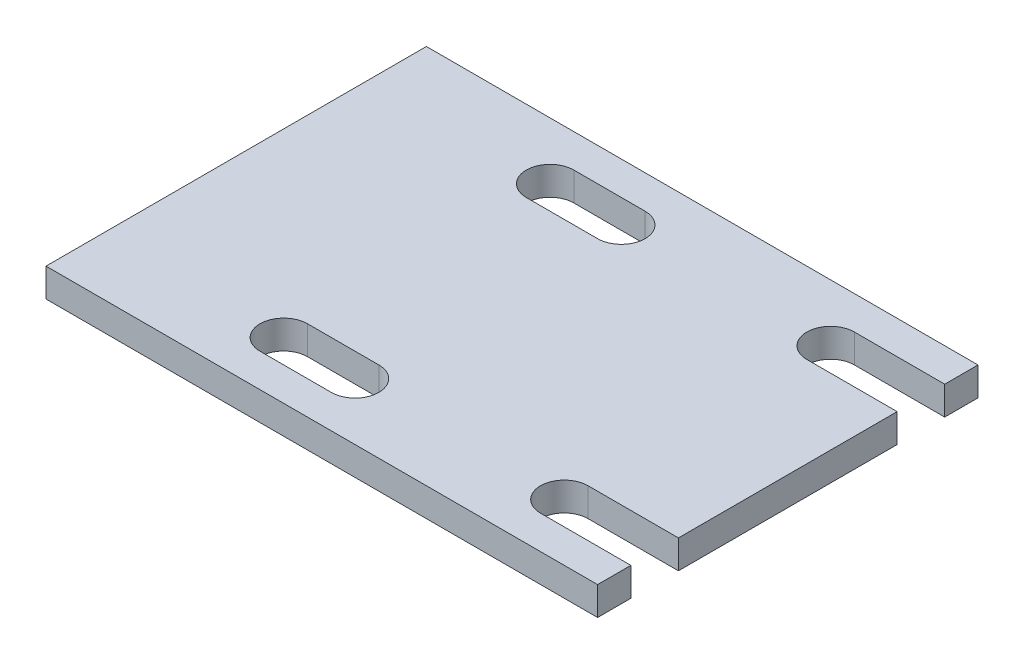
from build123d import *

# Parameters (mm, degrees)
SKETCH1_W           = 368.3
SKETCH1_H           = 254
BOSS_EXTRUDE1_DEPTH = 19.05
CUT_EXTRUDE2_DEPTH  = 448.798830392
CUT_EXTRUDE3_DEPTH  = 448.798830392


with BuildPart() as part:
    # Sketch1 → Boss-Extrude1 (new body)
    with BuildSketch(Plane(origin=(0, 0, 0), x_dir=(1, 0, 0), z_dir=(0, 1, 0))):
        with Locations((184.15, 127)):
            Rectangle(SKETCH1_W, SKETCH1_H)
    extrude(amount=BOSS_EXTRUDE1_DEPTH)

    # Sketch3 → Cut-Extrude2 (cut, through all)
    with BuildSketch(Plane(origin=(0, 19.05, 0), x_dir=(1, 0, 0), z_dir=(0, 1, 0))):
        with BuildLine():
            Line((120.65, 53.975), (168.275, 53.975))
            ThreePointArc((168.275, 53.975), (184.15, 38.1), (168.275, 22.225))
            Line((168.275, 22.225), (120.65, 22.225))
            ThreePointArc((120.65, 22.225), (104.775, 38.1), (120.65, 53.975))
        make_face()
        with BuildLine():
            Line((168.275, 231.775), (120.65, 231.775))
            ThreePointArc((120.65, 231.775), (104.775, 215.9), (120.65, 200.025))
            Line((120.65, 200.025), (168.275, 200.025))
            ThreePointArc((168.275, 200.025), (184.15, 215.9), (168.275, 231.775))
        make_face()
    extrude(amount=-CUT_EXTRUDE2_DEPTH, mode=Mode.SUBTRACT)

    # Sketch4 → Cut-Extrude3 (cut, through all)
    with BuildSketch(Plane(origin=(0, 19.05, 0), x_dir=(1, 0, 0), z_dir=(0, 1, 0))):
        with BuildLine():
            Line((307.975, 53.975), (368.3, 53.975))
            Line((368.3, 53.975), (368.3, 22.225))
            Line((368.3, 22.225), (307.975, 22.225))
            ThreePointArc((307.975, 22.225), (292.1, 38.1), (307.975, 53.975))
        make_face()
        with BuildLine():
            Line((307.975, 231.775), (368.3, 231.775))
            Line((368.3, 231.775), (368.3, 200.025))
            Line((368.3, 200.025), (307.975, 200.025))
            ThreePointArc((307.975, 200.025), (292.1, 215.9), (307.975, 231.775))
        make_face()
    extrude(amount=-CUT_EXTRUDE3_DEPTH, mode=Mode.SUBTRACT)


solid = part.part
